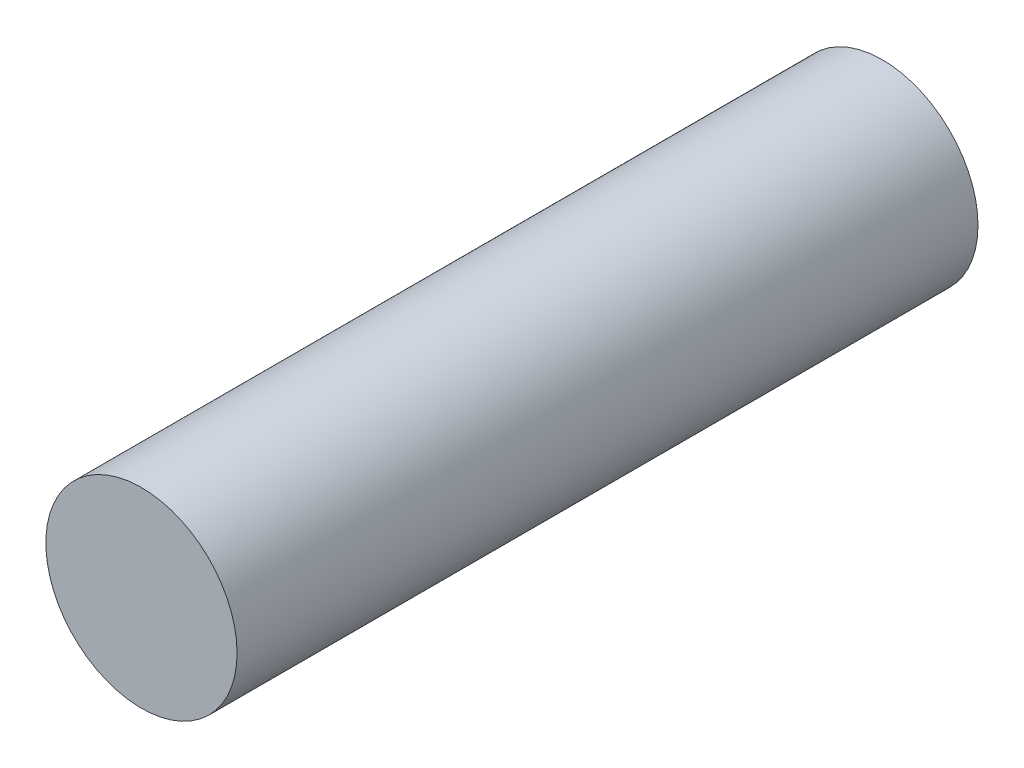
from build123d import *

# Parameters (mm, degrees)
SKIZZE1_R               = 64.52469302
LINEAR_AUSTRAGEN1_DEPTH = 250


with BuildPart() as part:
    # Skizze1 → Linear austragen1 (new, symmetric)
    with BuildSketch(Plane.XY):
        Circle(SKIZZE1_R)
    extrude(amount=LINEAR_AUSTRAGEN1_DEPTH, both=True)


solid = part.part
